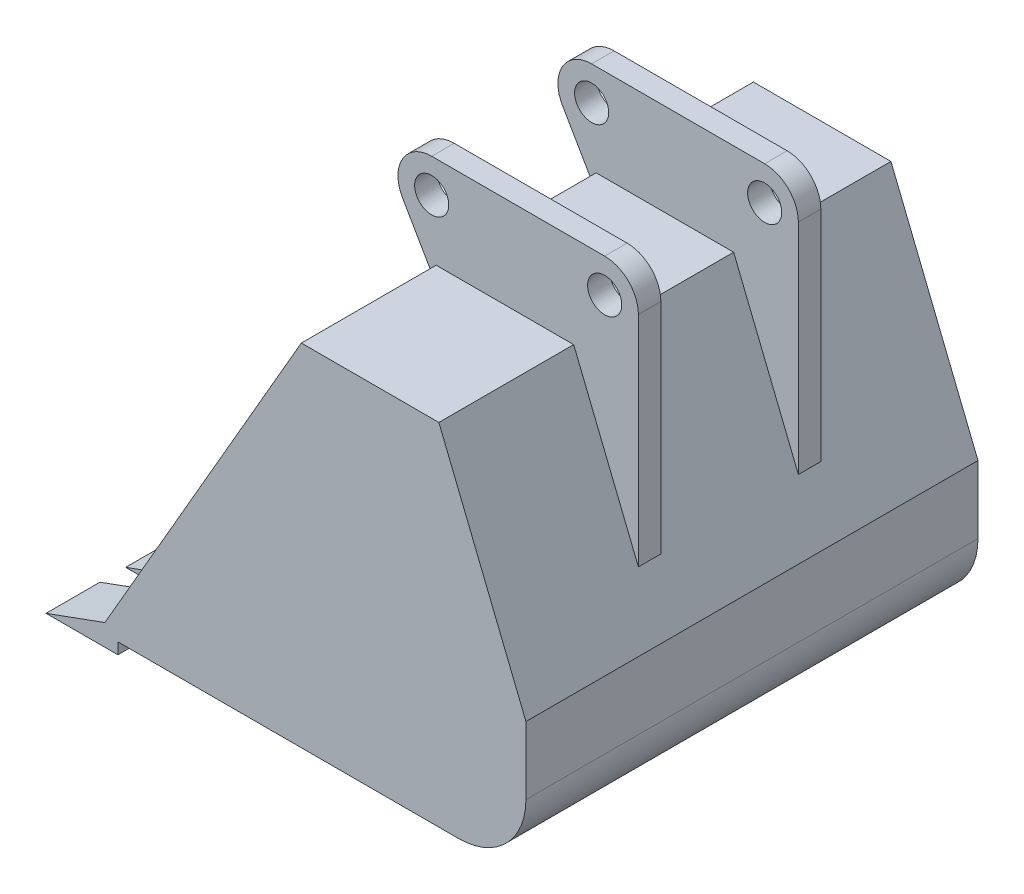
from build123d import *

# Parameters (mm, degrees)
BOSS_EXTRUDE1_DEPTH = 503
CUT_EXTRUDE1_START  = -503
CUT_EXTRUDE1_DEPTH  = 463
BOSS_EXTRUDE2_START = 153
SKETCH4_R           = 38
BOSS_EXTRUDE2_DEPTH = 50
SKETCH5_W           = 131.000444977
SKETCH5_H           = 57.2
CUT_EXTRUDE2_DEPTH  = 1411.23331403


with BuildPart() as part:
    # Sketch1 → Boss-Extrude1 (new, symmetric)
    with BuildSketch(Plane.XY):
        with BuildLine():
            Line((0, -150), (-758, -150))
            Line((-758, -150), (-758, -175))
            Line((-758, -175), (-918, -175))
            Line((-918, -175), (-786.999555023, -127.319737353))
            Line((-786.999555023, -127.319737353), (-349.7608008, 630))
            Line((-349.7608008, 630), (-43.7608008, 630))
            Line((-43.7608008, 630), (150, 150.425189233))
            Line((150, 150.425189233), (150, 0))
            ThreePointArc((150, 0), (106.066017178, -106.066017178), (0, -150))
        make_face()
    extrude(amount=BOSS_EXTRUDE1_DEPTH, both=True)

    # Sketch3 → Cut-Extrude1 (cut, symmetric)
    with BuildSketch(Plane.XY.offset(503).offset(CUT_EXTRUDE1_START)):
        with BuildLine():
            Line((-372.854811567, 590), (-777, -110))
            Line((-777, -110), (0, -110))
            ThreePointArc((0, -110), (77.781745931, -77.781745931), (110, 0))
            Line((110, 0), (110, 142.649976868))
            Line((110, 142.649976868), (-70.741141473, 590))
            Line((-70.741141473, 590), (-372.854811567, 590))
        make_face()
    extrude(amount=CUT_EXTRUDE1_DEPTH, both=True, mode=Mode.SUBTRACT)

    # Sketch4 → Boss-Extrude2 (add)
    with BuildSketch(Plane.XY.offset(BOSS_EXTRUDE2_START)):
        with BuildLine():
            Line((100.2391992, 273.587493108), (100.2391992, 760))
            ThreePointArc((100.2391992, 760), (78.272207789, 813.033008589), (25.2391992, 835))
            Line((25.2391992, 835), (-359.7608008, 835))
            ThreePointArc((-359.7608008, 835), (-424.712706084, 797.5), (-424.712706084, 722.5))
            Line((-424.712706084, 722.5), (-360.534303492, 611.339745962))
            Line((-360.534303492, 611.339745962), (-349.7608008, 630))
            Line((-349.7608008, 630), (-43.7608008, 630))
            Line((-43.7608008, 630), (100.2391992, 273.587493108))
        make_face()
        with Locations((-359.7608008, 760)):
            Circle(SKETCH4_R, mode=Mode.SUBTRACT)
        with Locations((25.2391992, 760)):
            Circle(SKETCH4_R, mode=Mode.SUBTRACT)
    boss_extrude2 = extrude(amount=BOSS_EXTRUDE2_DEPTH)

    # Mirror1: Boss-Extrude2 across plane
    add(boss_extrude2.mirror(Plane.XY))

    # Sketch5 → Cut-Extrude2 (cut, through all)
    with BuildSketch(Plane(origin=(0, -110, 0), x_dir=(1, 0, 0), z_dir=(0, 1, 0))):
        with Locations((-852.499777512, 354.4)):
            Rectangle(SKETCH5_W, SKETCH5_H)
        with Locations((-852.499777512, 177.2)):
            Rectangle(SKETCH5_W, SKETCH5_H)
        with Locations((-852.499777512, 0)):
            Rectangle(SKETCH5_W, SKETCH5_H)
        with Locations((-852.499777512, -177.2)):
            Rectangle(SKETCH5_W, SKETCH5_H)
        with Locations((-852.499777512, -354.4)):
            Rectangle(SKETCH5_W, SKETCH5_H)
    extrude(amount=-CUT_EXTRUDE2_DEPTH, mode=Mode.SUBTRACT)


solid = part.part
